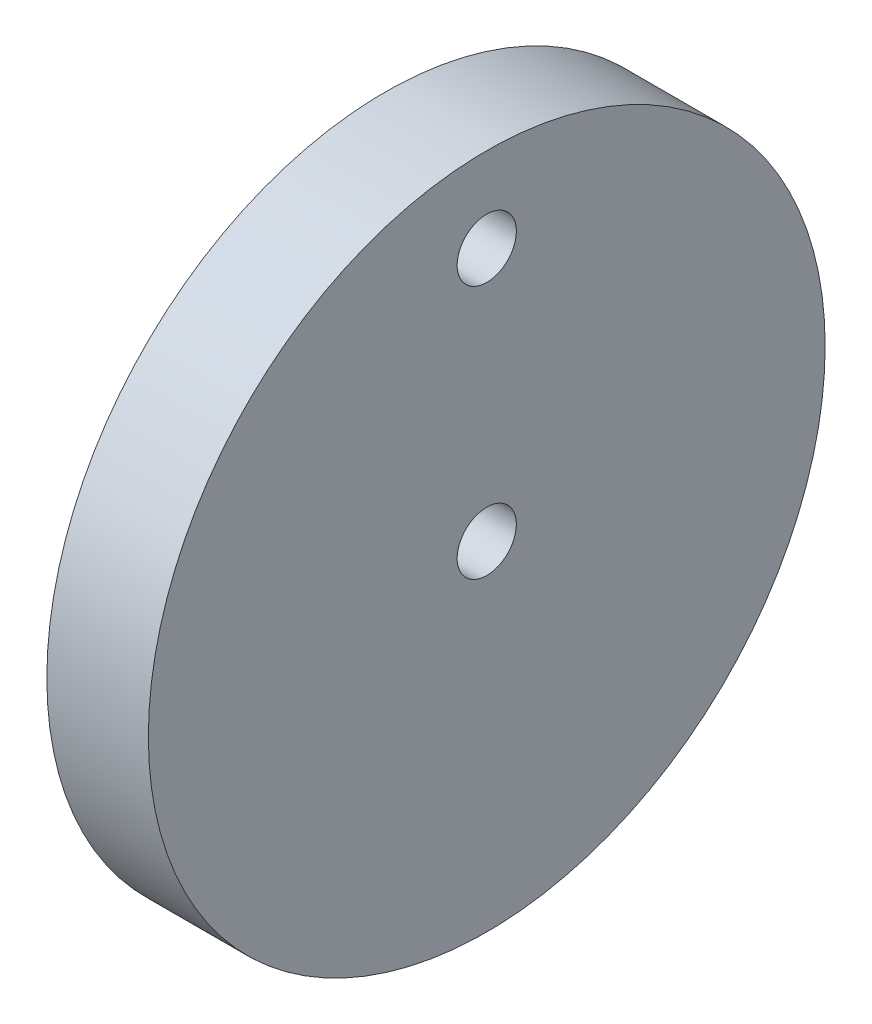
ISO-10303-21;
HEADER;
FILE_DESCRIPTION(('STEP AP214'),'2;1');
FILE_NAME('part.step','',(''),(''),'','','');
FILE_SCHEMA(('AUTOMOTIVE_DESIGN { 1 0 10303 214 1 1 1 1 }'));
ENDSEC;
DATA;
#1=APPLICATION_CONTEXT('core data for automotive mechanical design processes');
#2=APPLICATION_PROTOCOL_DEFINITION('international standard','automotive_design',2000,#1);
#3=PRODUCT_CONTEXT('',#1,'mechanical');
#4=PRODUCT('Part','Part','',(#3));
#5=PRODUCT_RELATED_PRODUCT_CATEGORY('part','',(#4));
#6=PRODUCT_DEFINITION_FORMATION('','',#4);
#7=PRODUCT_DEFINITION_CONTEXT('part definition',#1,'design');
#8=PRODUCT_DEFINITION('design','',#6,#7);
#9=PRODUCT_DEFINITION_SHAPE('','',#8);
#10=(LENGTH_UNIT() NAMED_UNIT(*) SI_UNIT(.MILLI.,.METRE.));
#11=(NAMED_UNIT(*) PLANE_ANGLE_UNIT() SI_UNIT($,.RADIAN.));
#12=(NAMED_UNIT(*) SI_UNIT($,.STERADIAN.) SOLID_ANGLE_UNIT());
#13=UNCERTAINTY_MEASURE_WITH_UNIT(LENGTH_MEASURE(1.E-05),#10,'distance_accuracy_value','');
#14=(GEOMETRIC_REPRESENTATION_CONTEXT(3) GLOBAL_UNCERTAINTY_ASSIGNED_CONTEXT((#13)) GLOBAL_UNIT_ASSIGNED_CONTEXT((#10,
#11,#12)) REPRESENTATION_CONTEXT('',''));
#15=CARTESIAN_POINT('',(0.,0.,0.));
#16=DIRECTION('',(0.,0.,1.));
#17=DIRECTION('',(1.,0.,0.));
#18=AXIS2_PLACEMENT_3D('',#15,#16,#17);
#19=CARTESIAN_POINT('',(6.,0.,0.));
#20=DIRECTION('',(1.,0.,0.));
#21=DIRECTION('',(0.,0.,-1.));
#22=AXIS2_PLACEMENT_3D('',#19,#20,#21);
#23=PLANE('',#22);
#24=CARTESIAN_POINT('',(6.,0.,0.));
#25=DIRECTION('',(1.,0.,0.));
#26=DIRECTION('',(0.,0.,-1.));
#27=AXIS2_PLACEMENT_3D('',#24,#25,#26);
#28=CIRCLE('',#27,1.75);
#29=CARTESIAN_POINT('',(6.,0.,-1.75));
#30=VERTEX_POINT('',#29);
#31=EDGE_CURVE('E39',#30,#30,#28,.T.);
#32=ORIENTED_EDGE('',*,*,#31,.F.);
#33=EDGE_LOOP('',(#32));
#34=FACE_BOUND('',#33,.T.);
#35=CARTESIAN_POINT('',(6.,0.,0.));
#36=DIRECTION('',(1.,0.,0.));
#37=DIRECTION('',(0.,0.,-1.));
#38=AXIS2_PLACEMENT_3D('',#35,#36,#37);
#39=CIRCLE('',#38,20.);
#40=CARTESIAN_POINT('',(6.,0.,-20.));
#41=VERTEX_POINT('',#40);
#42=EDGE_CURVE('E10',#41,#41,#39,.T.);
#43=ORIENTED_EDGE('',*,*,#42,.T.);
#44=EDGE_LOOP('',(#43));
#45=FACE_BOUND('',#44,.T.);
#46=CARTESIAN_POINT('',(6.,15.,0.));
#47=DIRECTION('',(1.,0.,0.));
#48=DIRECTION('',(0.,0.,-1.));
#49=AXIS2_PLACEMENT_3D('',#46,#47,#48);
#50=CIRCLE('',#49,1.75);
#51=CARTESIAN_POINT('',(6.,15.,-1.75));
#52=VERTEX_POINT('',#51);
#53=EDGE_CURVE('E44',#52,#52,#50,.T.);
#54=ORIENTED_EDGE('',*,*,#53,.F.);
#55=EDGE_LOOP('',(#54));
#56=FACE_BOUND('',#55,.T.);
#57=ADVANCED_FACE('F28',(#34,#45,#56),#23,.T.);
#58=CARTESIAN_POINT('',(0.,0.,0.));
#59=DIRECTION('',(1.,0.,0.));
#60=DIRECTION('',(0.,0.,-1.));
#61=AXIS2_PLACEMENT_3D('',#58,#59,#60);
#62=PLANE('',#61);
#63=CARTESIAN_POINT('',(0.,0.,0.));
#64=DIRECTION('',(1.,0.,0.));
#65=DIRECTION('',(0.,0.,-1.));
#66=AXIS2_PLACEMENT_3D('',#63,#64,#65);
#67=CIRCLE('',#66,1.75);
#68=CARTESIAN_POINT('',(0.,0.,-1.75));
#69=VERTEX_POINT('',#68);
#70=EDGE_CURVE('E41',#69,#69,#67,.T.);
#71=ORIENTED_EDGE('',*,*,#70,.T.);
#72=EDGE_LOOP('',(#71));
#73=FACE_BOUND('',#72,.T.);
#74=CARTESIAN_POINT('',(0.,0.,0.));
#75=DIRECTION('',(1.,0.,0.));
#76=DIRECTION('',(0.,0.,-1.));
#77=AXIS2_PLACEMENT_3D('',#74,#75,#76);
#78=CIRCLE('',#77,20.);
#79=CARTESIAN_POINT('',(0.,0.,-20.));
#80=VERTEX_POINT('',#79);
#81=EDGE_CURVE('E32',#80,#80,#78,.T.);
#82=ORIENTED_EDGE('',*,*,#81,.F.);
#83=EDGE_LOOP('',(#82));
#84=FACE_BOUND('',#83,.T.);
#85=CARTESIAN_POINT('',(0.,15.,0.));
#86=DIRECTION('',(1.,0.,0.));
#87=DIRECTION('',(0.,0.,-1.));
#88=AXIS2_PLACEMENT_3D('',#85,#86,#87);
#89=CIRCLE('',#88,1.75);
#90=CARTESIAN_POINT('',(0.,15.,-1.75));
#91=VERTEX_POINT('',#90);
#92=EDGE_CURVE('E47',#91,#91,#89,.T.);
#93=ORIENTED_EDGE('',*,*,#92,.T.);
#94=EDGE_LOOP('',(#93));
#95=FACE_BOUND('',#94,.T.);
#96=ADVANCED_FACE('F57',(#73,#84,#95),#62,.F.);
#97=CARTESIAN_POINT('',(6.,0.,0.));
#98=DIRECTION('',(-1.,0.,0.));
#99=DIRECTION('',(0.,0.,1.));
#100=AXIS2_PLACEMENT_3D('',#97,#98,#99);
#101=CYLINDRICAL_SURFACE('',#100,20.);
#102=ORIENTED_EDGE('',*,*,#42,.F.);
#103=EDGE_LOOP('',(#102));
#104=FACE_BOUND('',#103,.T.);
#105=ORIENTED_EDGE('',*,*,#81,.T.);
#106=EDGE_LOOP('',(#105));
#107=FACE_BOUND('',#106,.T.);
#108=ADVANCED_FACE('F30',(#104,#107),#101,.T.);
#109=CARTESIAN_POINT('',(6.,0.,0.));
#110=DIRECTION('',(-1.,0.,0.));
#111=DIRECTION('',(0.,0.,1.));
#112=AXIS2_PLACEMENT_3D('',#109,#110,#111);
#113=CYLINDRICAL_SURFACE('',#112,1.75);
#114=ORIENTED_EDGE('',*,*,#31,.T.);
#115=EDGE_LOOP('',(#114));
#116=FACE_BOUND('',#115,.T.);
#117=ORIENTED_EDGE('',*,*,#70,.F.);
#118=EDGE_LOOP('',(#117));
#119=FACE_BOUND('',#118,.T.);
#120=ADVANCED_FACE('F66',(#116,#119),#113,.F.);
#121=CARTESIAN_POINT('',(6.,15.,0.));
#122=DIRECTION('',(-1.,0.,0.));
#123=DIRECTION('',(0.,0.,1.));
#124=AXIS2_PLACEMENT_3D('',#121,#122,#123);
#125=CYLINDRICAL_SURFACE('',#124,1.75);
#126=ORIENTED_EDGE('',*,*,#53,.T.);
#127=EDGE_LOOP('',(#126));
#128=FACE_BOUND('',#127,.T.);
#129=ORIENTED_EDGE('',*,*,#92,.F.);
#130=EDGE_LOOP('',(#129));
#131=FACE_BOUND('',#130,.T.);
#132=ADVANCED_FACE('F53',(#128,#131),#125,.F.);
#133=CLOSED_SHELL('',(#57,#96,#108,#120,#132));
#134=MANIFOLD_SOLID_BREP('B2',#133);
#135=ADVANCED_BREP_SHAPE_REPRESENTATION('',(#18,#134),#14);
#136=SHAPE_DEFINITION_REPRESENTATION(#9,#135);
ENDSEC;
END-ISO-10303-21;
